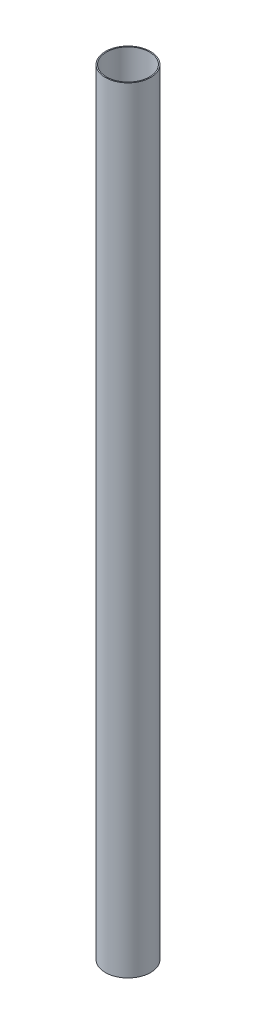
from build123d import *

# Parameters (mm, degrees)
SKETCH1_R      = 53.34
SKETCH1_R_2    = 50.8
EXTRUDE1_DEPTH = 1828.8


with BuildPart() as part:
    # Sketch1 → Extrude1 (new body)
    with BuildSketch(Plane(origin=(0, 0, 0), x_dir=(1, 0, 0), z_dir=(0, 1, 0))):
        with Locations(Location((0, 0, 0), (0, 0, 270))):
            Circle(SKETCH1_R)
        with Locations(Location((0, 0, 0), (0, 0, 270))):
            Circle(SKETCH1_R_2, mode=Mode.SUBTRACT)
    extrude(amount=EXTRUDE1_DEPTH)


solid = part.part
